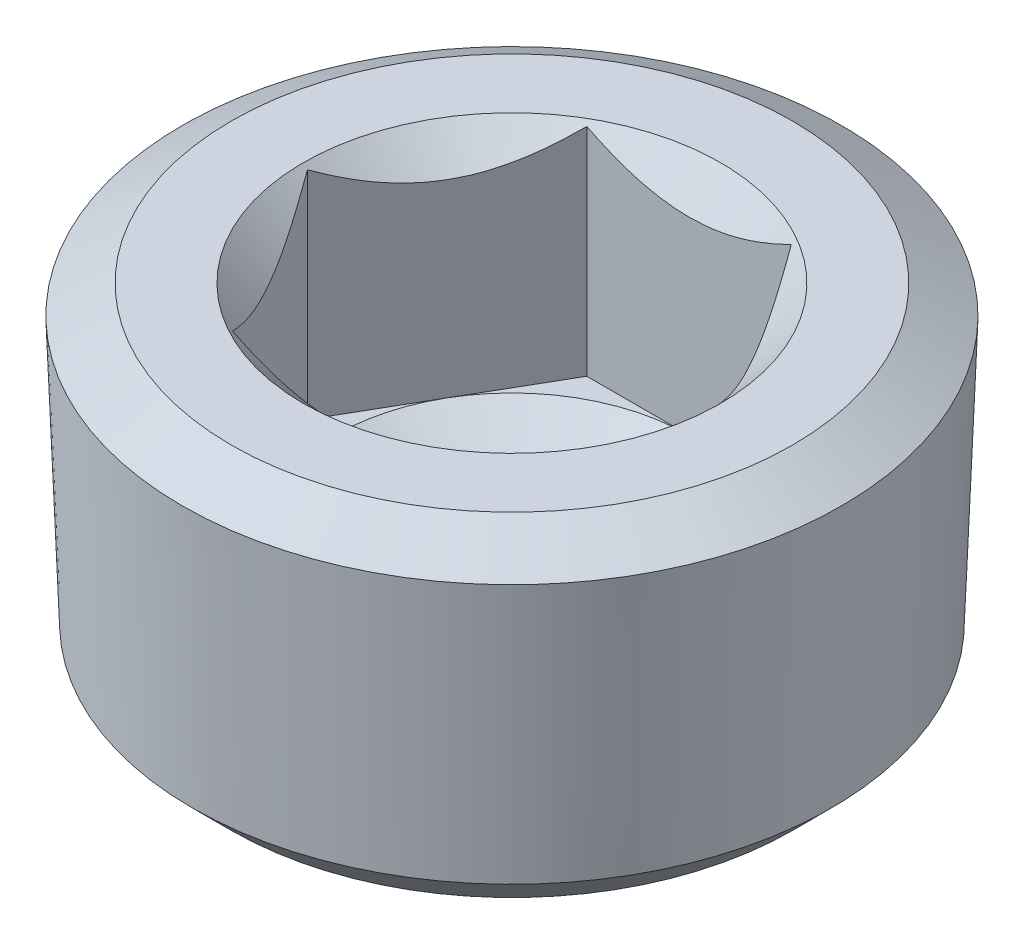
from build123d import *

# Parameters (mm, degrees)
CUT_EXTRUDE1_START = -8.89
CUT_EXTRUDE1_DEPTH = 8.725142


with BuildPart() as part:
    # Sketch2 → Revolve1 (revolve)
    with BuildSketch(Plane.XY, mode=Mode.PRIVATE) as revolve1_sk:
        Polygon((0, 0), (-11.320194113, 0), (-13.293463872, -1.139267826), (-12.901859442, -11.880334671), (-11.320194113, -13.462), (0, -13.462), align=None)
    revolve(revolve1_sk.sketch.rotate(Axis((0, 10.744282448, 0), (0, -1, 0)), 270), axis=Axis((0, 10.744282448, 0), (0, -1, 0)))

    # Sketch3 → Cut-Revolve1 (revolve, cut)
    with BuildSketch(Plane.XY, mode=Mode.PRIVATE) as cut_revolve1_sk:
        Polygon((0, 0), (-8.41375, 0), (-7.14375, -1.27), (-7.14375, -8.89), (-5.030115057, -10.16), (0, -10.16), align=None)
    revolve(cut_revolve1_sk.sketch.rotate(Axis((0, 2.934222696, 0), (0, -1, 0)), 270), axis=Axis((0, 2.934222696, 0), (0, -1, 0)), mode=Mode.SUBTRACT)

    # Sketch4 → Cut-Extrude1 (cut)
    with BuildSketch(Plane(origin=(0, 0, 0), x_dir=(1, 0, 0), z_dir=(0, 1, 0)).offset(CUT_EXTRUDE1_START)):
        Polygon((-4.124445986, -7.14375), (4.124445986, -7.14375), (8.248891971, 0), (4.124445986, 7.14375), (-4.124445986, 7.14375), (-8.248891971, 0), align=None)
    extrude(amount=CUT_EXTRUDE1_DEPTH, mode=Mode.SUBTRACT)


solid = part.part
